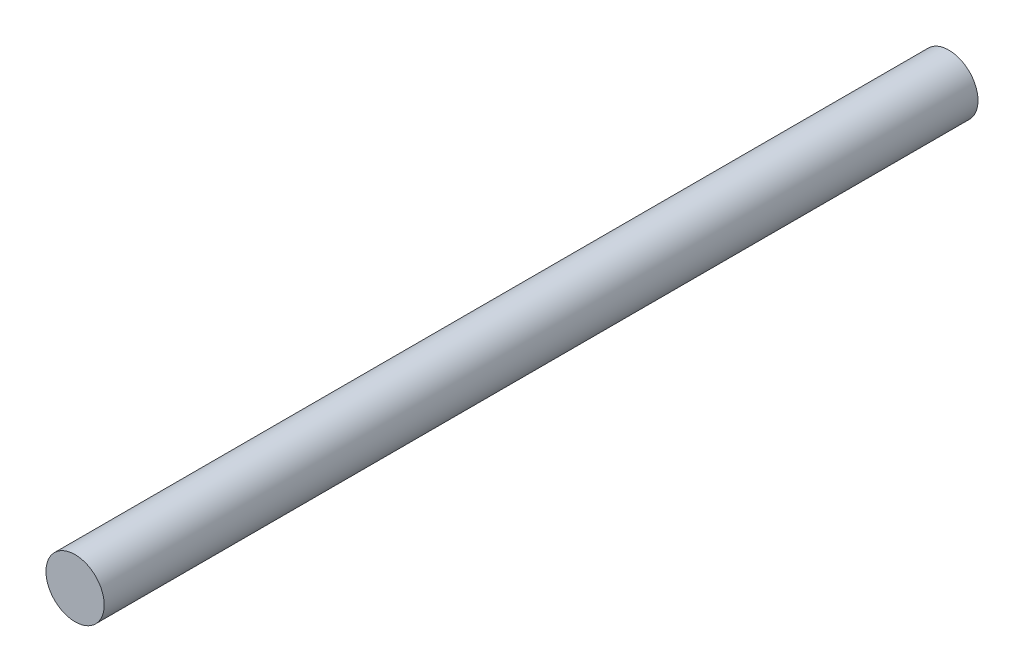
from build123d import *

# Parameters (mm, degrees)
SKETCH1_R           = 30
BOSS_EXTRUDE1_DEPTH = 900


with BuildPart() as part:
    # Sketch1 → Boss-Extrude1 (new body)
    with BuildSketch(Plane.XY):
        Circle(SKETCH1_R)
    extrude(amount=-BOSS_EXTRUDE1_DEPTH)


solid = part.part
